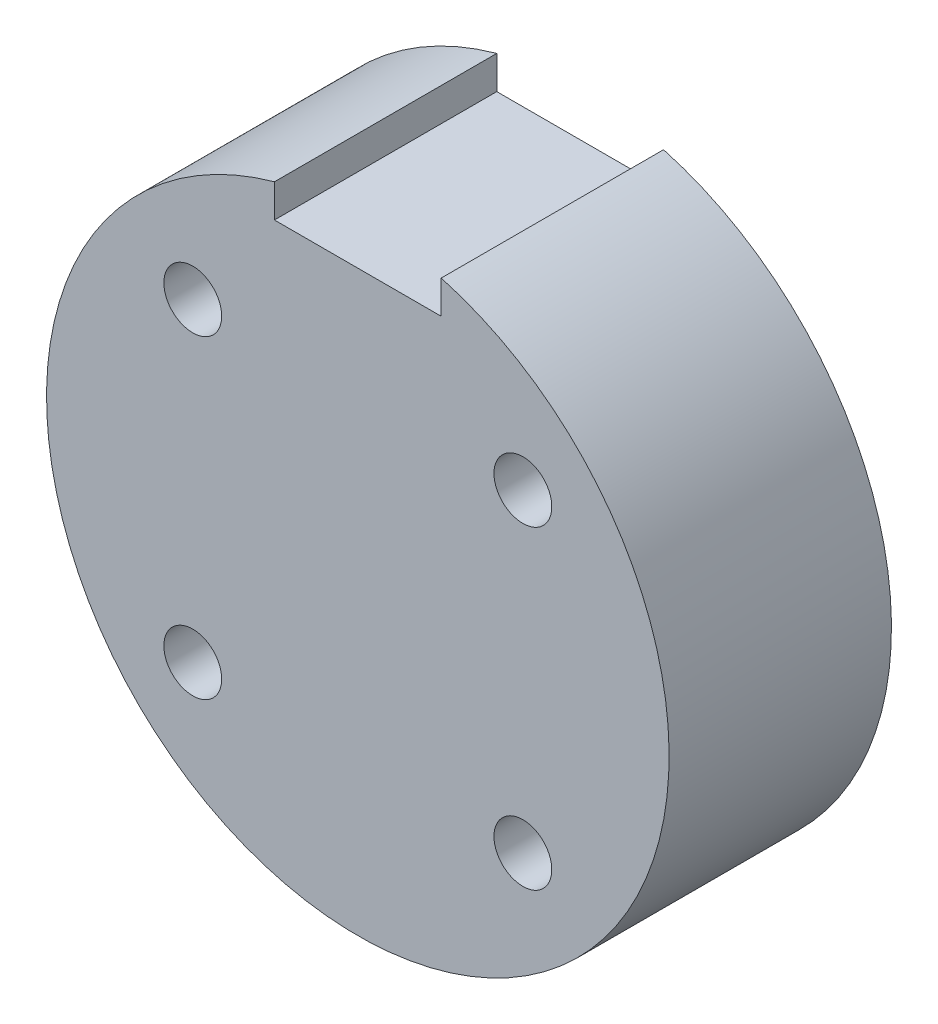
from build123d import *

# Parameters (mm, degrees)
SKETCH_1_R          = 28
EXTRUDE_3_DEPTH     = 20
SKETCH_15_R         = 2.6
CUT_EXTRUDE_1_DEPTH = 45.362146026
CUT_EXTRUDE_START   = -21
SKETCH_16_W         = 15
SKETCH_16_H         = 20
CUT_EXTRUDE_4_DEPTH = 5
SKETCH_17_R         = 7.5
CUT_EXTRUDE_5_DEPTH = 8
CUT_EXTRUDE_START_2 = 21
SKETCH_18_R         = 2.5
CUT_EXTRUDE_6_DEPTH = 15


with BuildPart() as part:
    # Sketch 1 → Extrude 3 (new body)
    with BuildSketch(Plane.XY):
        Circle(SKETCH_1_R)
    extrude(amount=EXTRUDE_3_DEPTH)

    # Sketch 15 → Cut-Extrude 1 (cut, through all)
    with BuildSketch(Plane(origin=(0, 0, 0), x_dir=(-1, 0, 0), z_dir=(0, 0, -1))):
        with Locations((-14.845865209, 14.13684145)):
            Circle(SKETCH_15_R)
        with Locations((14.845865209, 14.13684145)):
            Circle(SKETCH_15_R)
        with Locations((14.845865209, -14.13684145)):
            Circle(SKETCH_15_R)
        with Locations((-14.845865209, -14.13684145)):
            Circle(SKETCH_15_R)
    extrude(amount=-CUT_EXTRUDE_1_DEPTH, mode=Mode.SUBTRACT)

    # Sketch 16 → Cut-Extrude 4 (cut)
    with BuildSketch(Plane(origin=(0, 50, 0), x_dir=(1, 0, 0), z_dir=(0, 1, 0)).offset(CUT_EXTRUDE_START)):
        with Locations((0, -10)):
            Rectangle(SKETCH_16_W, SKETCH_16_H)
    extrude(amount=-CUT_EXTRUDE_4_DEPTH, mode=Mode.SUBTRACT)

    # Sketch 17 → Cut-Extrude 5 (cut)
    with BuildSketch(Plane(origin=(0, 0, 0), x_dir=(-1, 0, 0), z_dir=(0, 0, -1))):
        Circle(SKETCH_17_R)
    extrude(amount=-CUT_EXTRUDE_5_DEPTH, mode=Mode.SUBTRACT)

    # Sketch 18 → Cut-Extrude 6 (cut)
    with BuildSketch(Plane(origin=(0, -50, 0), x_dir=(1, 0, 0), z_dir=(0, 1, 0)).offset(CUT_EXTRUDE_START_2)):
        with Locations(Location((0, -10, 0), (0, 0, 90))):
            Circle(SKETCH_18_R)
    extrude(amount=CUT_EXTRUDE_6_DEPTH, mode=Mode.SUBTRACT)


solid = part.part
